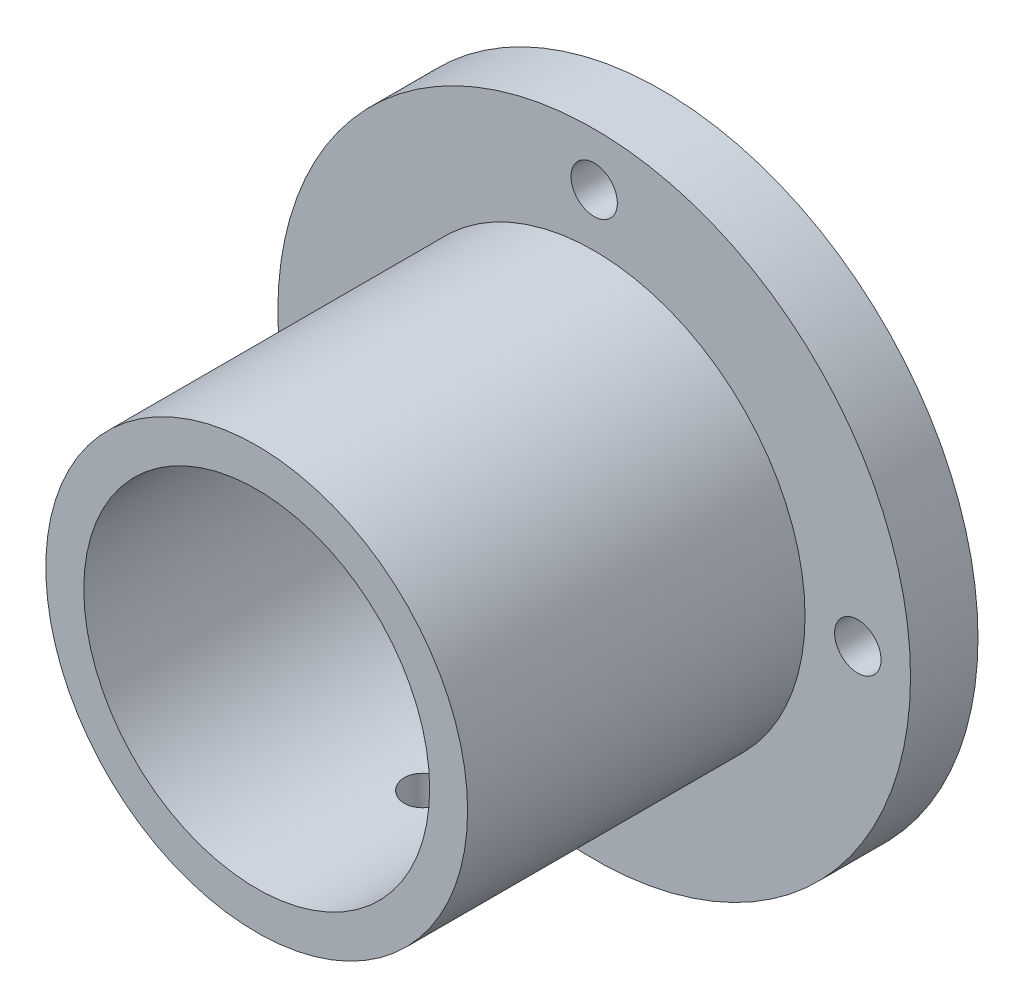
from build123d import *

# Parameters (mm, degrees)
SKETCH_2_R          = 37.5
SKETCH_2_R_2        = 2.75
EXTRUDE_1_DEPTH     = 8
SKETCH_3_R          = 25
EXTRUDE_2_DEPTH     = 40
SKETCH_4_R          = 20.5
CUT_EXTRUDE_1_DEPTH = 72.529714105
SKETCH_5_R          = 2.5
CUT_EXTRUDE_2_DEPTH = 40


with BuildPart() as part:
    # Sketch 2 → Extrude 1 (new body)
    with BuildSketch(Plane.XY):
        Circle(SKETCH_2_R)
        with Locations((0, -31.25)):
            Circle(SKETCH_2_R_2, mode=Mode.SUBTRACT)
        with Locations((31.25, 0)):
            Circle(SKETCH_2_R_2, mode=Mode.SUBTRACT)
        with Locations((0, 31.25)):
            Circle(SKETCH_2_R_2, mode=Mode.SUBTRACT)
        with Locations((-31.25, 0)):
            Circle(SKETCH_2_R_2, mode=Mode.SUBTRACT)
    extrude(amount=EXTRUDE_1_DEPTH)

    # Sketch 3 → Extrude 2 (add)
    with BuildSketch(Plane.XY.offset(8)):
        Circle(SKETCH_3_R)
    extrude(amount=EXTRUDE_2_DEPTH)

    # Sketch 4 → Cut-Extrude 1 (cut, through all)
    with BuildSketch(Plane.XY.offset(48)):
        Circle(SKETCH_4_R)
    extrude(amount=-CUT_EXTRUDE_1_DEPTH, mode=Mode.SUBTRACT)

    # Sketch 5 → Cut-Extrude 2 (cut)
    with BuildSketch(Plane(origin=(0, 10, 0), x_dir=(-1, 0, 0), z_dir=(0, 1, 0))):
        with Locations(Location((0, 28, 0), (0, 0, 90))):
            Circle(SKETCH_5_R)
    extrude(amount=-CUT_EXTRUDE_2_DEPTH, mode=Mode.SUBTRACT)


solid = part.part
